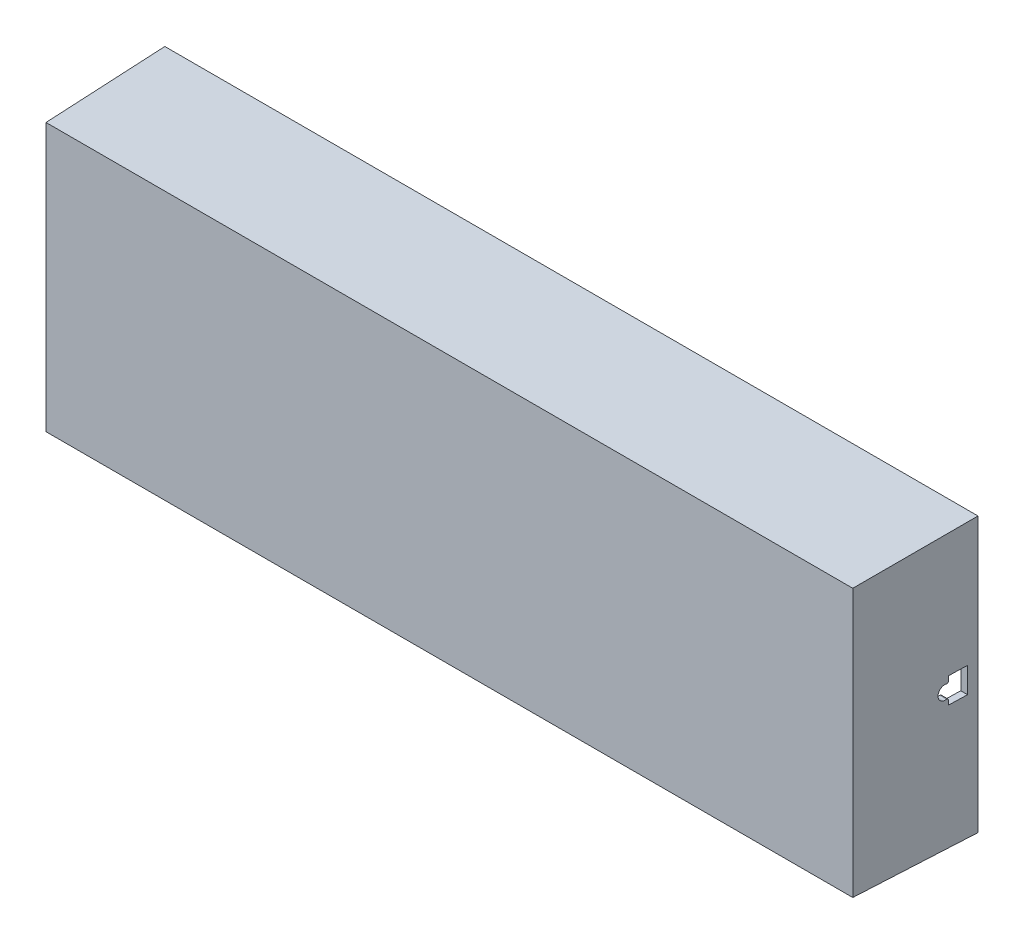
ISO-10303-21;
HEADER;
FILE_DESCRIPTION(('STEP AP214'),'2;1');
FILE_NAME('part.step','',(''),(''),'','','');
FILE_SCHEMA(('AUTOMOTIVE_DESIGN { 1 0 10303 214 1 1 1 1 }'));
ENDSEC;
DATA;
#1=APPLICATION_CONTEXT('core data for automotive mechanical design processes');
#2=APPLICATION_PROTOCOL_DEFINITION('international standard','automotive_design',2000,#1);
#3=PRODUCT_CONTEXT('',#1,'mechanical');
#4=PRODUCT('Part','Part','',(#3));
#5=PRODUCT_RELATED_PRODUCT_CATEGORY('part','',(#4));
#6=PRODUCT_DEFINITION_FORMATION('','',#4);
#7=PRODUCT_DEFINITION_CONTEXT('part definition',#1,'design');
#8=PRODUCT_DEFINITION('design','',#6,#7);
#9=PRODUCT_DEFINITION_SHAPE('','',#8);
#10=(LENGTH_UNIT() NAMED_UNIT(*) SI_UNIT(.MILLI.,.METRE.));
#11=(NAMED_UNIT(*) PLANE_ANGLE_UNIT() SI_UNIT($,.RADIAN.));
#12=(NAMED_UNIT(*) SI_UNIT($,.STERADIAN.) SOLID_ANGLE_UNIT());
#13=UNCERTAINTY_MEASURE_WITH_UNIT(LENGTH_MEASURE(1.E-05),#10,'distance_accuracy_value','');
#14=(GEOMETRIC_REPRESENTATION_CONTEXT(3) GLOBAL_UNCERTAINTY_ASSIGNED_CONTEXT((#13)) GLOBAL_UNIT_ASSIGNED_CONTEXT((#10,
#11,#12)) REPRESENTATION_CONTEXT('',''));
#15=CARTESIAN_POINT('',(0.,0.,0.));
#16=DIRECTION('',(0.,0.,1.));
#17=DIRECTION('',(1.,0.,0.));
#18=AXIS2_PLACEMENT_3D('',#15,#16,#17);
#19=CARTESIAN_POINT('',(-119.95,40.45,0.));
#20=DIRECTION('',(-0.999657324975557,0.,0.0261769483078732));
#21=DIRECTION('',(0.0261769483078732,0.,0.999657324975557));
#22=AXIS2_PLACEMENT_3D('',#19,#20,#21);
#23=PLANE('',#22);
#24=DIRECTION('',(0.0261769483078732,0.,0.999657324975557));
#25=VECTOR('',#24,1.);
#26=CARTESIAN_POINT('',(-119.95,-3.75,0.));
#27=LINE('',#26,#25);
#28=CARTESIAN_POINT('',(-119.727419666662,-3.75,8.5));
#29=VERTEX_POINT('',#28);
#30=CARTESIAN_POINT('',(-119.871442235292,-3.75,3.));
#31=VERTEX_POINT('',#30);
#32=EDGE_CURVE('E310',#29,#31,#27,.F.);
#33=ORIENTED_EDGE('',*,*,#32,.T.);
#34=DIRECTION('',(0.,-1.,0.));
#35=VECTOR('',#34,1.);
#36=CARTESIAN_POINT('',(-119.871442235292,40.45,3.));
#37=LINE('',#36,#35);
#38=CARTESIAN_POINT('',(-119.871442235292,3.75,3.));
#39=VERTEX_POINT('',#38);
#40=EDGE_CURVE('E302',#31,#39,#37,.F.);
#41=ORIENTED_EDGE('',*,*,#40,.T.);
#42=DIRECTION('',(-0.0261769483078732,0.,-0.999657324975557));
#43=VECTOR('',#42,1.);
#44=CARTESIAN_POINT('',(-119.95,3.75,0.));
#45=LINE('',#44,#43);
#46=CARTESIAN_POINT('',(-119.727419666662,3.75,8.5));
#47=VERTEX_POINT('',#46);
#48=EDGE_CURVE('E288',#39,#47,#45,.F.);
#49=ORIENTED_EDGE('',*,*,#48,.T.);
#50=DIRECTION('',(0.,1.,0.));
#51=VECTOR('',#50,1.);
#52=CARTESIAN_POINT('',(-119.727419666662,40.45,8.5));
#53=LINE('',#52,#51);
#54=CARTESIAN_POINT('',(-119.727419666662,2.44948974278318,8.5));
#55=VERTEX_POINT('',#54);
#56=EDGE_CURVE('E922',#47,#55,#53,.F.);
#57=ORIENTED_EDGE('',*,*,#56,.T.);
#58=CARTESIAN_POINT('',(-119.714326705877,2.44948974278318,9.));
#59=DIRECTION('',(-0.999657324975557,0.,0.0261769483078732));
#60=DIRECTION('',(0.0261769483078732,0.,0.999657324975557));
#61=AXIS2_PLACEMENT_3D('',#58,#59,#60);
#62=ELLIPSE('',#61,0.500171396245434,0.5);
#63=CARTESIAN_POINT('',(-119.71170811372,1.95959179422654,9.1));
#64=VERTEX_POINT('',#63);
#65=EDGE_CURVE('E929',#55,#64,#62,.T.);
#66=ORIENTED_EDGE('',*,*,#65,.T.);
#67=CARTESIAN_POINT('',(-119.701233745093,0.,9.5));
#68=DIRECTION('',(-0.999657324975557,0.,0.0261769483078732));
#69=DIRECTION('',(0.0261769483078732,0.,0.999657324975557));
#70=AXIS2_PLACEMENT_3D('',#67,#68,#69);
#71=ELLIPSE('',#70,2.00068558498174,2.);
#72=CARTESIAN_POINT('',(-119.71170811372,-1.95959179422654,9.1));
#73=VERTEX_POINT('',#72);
#74=EDGE_CURVE('E938',#64,#73,#71,.F.);
#75=ORIENTED_EDGE('',*,*,#74,.T.);
#76=CARTESIAN_POINT('',(-119.714326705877,-2.44948974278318,9.));
#77=DIRECTION('',(-0.999657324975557,0.,0.0261769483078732));
#78=DIRECTION('',(0.0261769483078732,0.,0.999657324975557));
#79=AXIS2_PLACEMENT_3D('',#76,#77,#78);
#80=ELLIPSE('',#79,0.500171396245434,0.5);
#81=CARTESIAN_POINT('',(-119.727419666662,-2.44948974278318,8.5));
#82=VERTEX_POINT('',#81);
#83=EDGE_CURVE('E947',#73,#82,#80,.T.);
#84=ORIENTED_EDGE('',*,*,#83,.T.);
#85=DIRECTION('',(0.,1.,0.));
#86=VECTOR('',#85,1.);
#87=CARTESIAN_POINT('',(-119.727419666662,40.45,8.5));
#88=LINE('',#87,#86);
#89=EDGE_CURVE('E956',#82,#29,#88,.F.);
#90=ORIENTED_EDGE('',*,*,#89,.T.);
#91=EDGE_LOOP('',(#33,#41,#49,#57,#66,#75,#84,#90));
#92=FACE_BOUND('',#91,.T.);
#93=DIRECTION('',(0.,-1.,0.));
#94=VECTOR('',#93,1.);
#95=CARTESIAN_POINT('',(-119.95,40.45,0.));
#96=LINE('',#95,#94);
#97=CARTESIAN_POINT('',(-119.95,40.45,0.));
#98=VERTEX_POINT('',#97);
#99=CARTESIAN_POINT('',(-119.95,-40.45,0.));
#100=VERTEX_POINT('',#99);
#101=EDGE_CURVE('E478',#98,#100,#96,.T.);
#102=ORIENTED_EDGE('',*,*,#101,.T.);
#103=DIRECTION('',(-0.0261679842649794,-0.0261679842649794,-0.99931500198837));
#104=VECTOR('',#103,1.);
#105=CARTESIAN_POINT('',(-119.95,-40.45,0.));
#106=LINE('',#105,#104);
#107=CARTESIAN_POINT('',(-119.007306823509,-39.5073068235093,36.));
#108=VERTEX_POINT('',#107);
#109=EDGE_CURVE('E465',#108,#100,#106,.T.);
#110=ORIENTED_EDGE('',*,*,#109,.F.);
#111=DIRECTION('',(0.,1.,0.));
#112=VECTOR('',#111,1.);
#113=CARTESIAN_POINT('',(-119.007306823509,40.45,36.));
#114=LINE('',#113,#112);
#115=CARTESIAN_POINT('',(-119.007306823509,39.5073068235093,36.));
#116=VERTEX_POINT('',#115);
#117=EDGE_CURVE('E458',#116,#108,#114,.F.);
#118=ORIENTED_EDGE('',*,*,#117,.F.);
#119=DIRECTION('',(-0.0261679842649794,0.0261679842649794,-0.99931500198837));
#120=VECTOR('',#119,1.);
#121=CARTESIAN_POINT('',(-119.95,40.45,0.));
#122=LINE('',#121,#120);
#123=EDGE_CURVE('E453',#116,#98,#122,.T.);
#124=ORIENTED_EDGE('',*,*,#123,.T.);
#125=EDGE_LOOP('',(#102,#110,#118,#124));
#126=FACE_BOUND('',#125,.T.);
#127=ADVANCED_FACE('F33',(#92,#126),#23,.T.);
#128=CARTESIAN_POINT('',(-119.95,-40.45,0.));
#129=DIRECTION('',(0.,-0.999657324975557,0.0261769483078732));
#130=DIRECTION('',(0.,-0.0261769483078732,-0.999657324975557));
#131=AXIS2_PLACEMENT_3D('',#128,#129,#130);
#132=PLANE('',#131);
#133=DIRECTION('',(1.,0.,0.));
#134=VECTOR('',#133,1.);
#135=CARTESIAN_POINT('',(-119.95,-40.45,0.));
#136=LINE('',#135,#134);
#137=CARTESIAN_POINT('',(119.95,-40.45,0.));
#138=VERTEX_POINT('',#137);
#139=EDGE_CURVE('E476',#100,#138,#136,.T.);
#140=ORIENTED_EDGE('',*,*,#139,.T.);
#141=DIRECTION('',(0.0261679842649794,-0.0261679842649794,-0.99931500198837));
#142=VECTOR('',#141,1.);
#143=CARTESIAN_POINT('',(119.8946026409,-40.3946026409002,2.11553979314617));
#144=LINE('',#143,#142);
#145=CARTESIAN_POINT('',(119.007306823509,-39.5073068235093,36.));
#146=VERTEX_POINT('',#145);
#147=EDGE_CURVE('E462',#146,#138,#144,.T.);
#148=ORIENTED_EDGE('',*,*,#147,.F.);
#149=DIRECTION('',(-1.,0.,0.));
#150=VECTOR('',#149,1.);
#151=CARTESIAN_POINT('',(-119.95,-39.5073068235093,36.));
#152=LINE('',#151,#150);
#153=EDGE_CURVE('E456',#108,#146,#152,.F.);
#154=ORIENTED_EDGE('',*,*,#153,.F.);
#155=ORIENTED_EDGE('',*,*,#109,.T.);
#156=EDGE_LOOP('',(#140,#148,#154,#155));
#157=FACE_BOUND('',#156,.T.);
#158=ADVANCED_FACE('F35',(#157),#132,.T.);
#159=CARTESIAN_POINT('',(119.95,40.45,0.));
#160=DIRECTION('',(0.999657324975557,0.,0.0261769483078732));
#161=DIRECTION('',(0.0261769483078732,0.,-0.999657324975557));
#162=AXIS2_PLACEMENT_3D('',#159,#160,#161);
#163=PLANE('',#162);
#164=DIRECTION('',(-0.0261769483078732,0.,0.999657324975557));
#165=VECTOR('',#164,1.);
#166=CARTESIAN_POINT('',(119.95,3.75,0.));
#167=LINE('',#166,#165);
#168=CARTESIAN_POINT('',(119.727419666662,3.75,8.5));
#169=VERTEX_POINT('',#168);
#170=CARTESIAN_POINT('',(119.871442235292,3.75,3.));
#171=VERTEX_POINT('',#170);
#172=EDGE_CURVE('E297',#169,#171,#167,.F.);
#173=ORIENTED_EDGE('',*,*,#172,.T.);
#174=DIRECTION('',(0.,1.,0.));
#175=VECTOR('',#174,1.);
#176=CARTESIAN_POINT('',(119.871442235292,40.45,3.));
#177=LINE('',#176,#175);
#178=CARTESIAN_POINT('',(119.871442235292,-3.75,3.));
#179=VERTEX_POINT('',#178);
#180=EDGE_CURVE('E312',#171,#179,#177,.F.);
#181=ORIENTED_EDGE('',*,*,#180,.T.);
#182=DIRECTION('',(0.0261769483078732,0.,-0.999657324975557));
#183=VECTOR('',#182,1.);
#184=CARTESIAN_POINT('',(119.95,-3.75,0.));
#185=LINE('',#184,#183);
#186=CARTESIAN_POINT('',(119.727419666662,-3.75,8.5));
#187=VERTEX_POINT('',#186);
#188=EDGE_CURVE('E960',#179,#187,#185,.F.);
#189=ORIENTED_EDGE('',*,*,#188,.T.);
#190=DIRECTION('',(0.,-1.,0.));
#191=VECTOR('',#190,1.);
#192=CARTESIAN_POINT('',(119.727419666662,40.45,8.5));
#193=LINE('',#192,#191);
#194=CARTESIAN_POINT('',(119.727419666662,-2.44948974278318,8.5));
#195=VERTEX_POINT('',#194);
#196=EDGE_CURVE('E953',#187,#195,#193,.F.);
#197=ORIENTED_EDGE('',*,*,#196,.T.);
#198=CARTESIAN_POINT('',(119.714326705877,-2.44948974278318,9.));
#199=DIRECTION('',(0.999657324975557,0.,0.0261769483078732));
#200=DIRECTION('',(0.0261769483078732,0.,-0.999657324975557));
#201=AXIS2_PLACEMENT_3D('',#198,#199,#200);
#202=ELLIPSE('',#201,0.500171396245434,0.5);
#203=CARTESIAN_POINT('',(119.71170811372,-1.95959179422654,9.1));
#204=VERTEX_POINT('',#203);
#205=EDGE_CURVE('E944',#195,#204,#202,.T.);
#206=ORIENTED_EDGE('',*,*,#205,.T.);
#207=CARTESIAN_POINT('',(119.701233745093,0.,9.5));
#208=DIRECTION('',(0.999657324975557,0.,0.0261769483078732));
#209=DIRECTION('',(0.0261769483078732,0.,-0.999657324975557));
#210=AXIS2_PLACEMENT_3D('',#207,#208,#209);
#211=ELLIPSE('',#210,2.00068558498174,2.);
#212=CARTESIAN_POINT('',(119.71170811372,1.95959179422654,9.1));
#213=VERTEX_POINT('',#212);
#214=EDGE_CURVE('E935',#204,#213,#211,.F.);
#215=ORIENTED_EDGE('',*,*,#214,.T.);
#216=CARTESIAN_POINT('',(119.714326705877,2.44948974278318,9.));
#217=DIRECTION('',(0.999657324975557,0.,0.0261769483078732));
#218=DIRECTION('',(0.0261769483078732,0.,-0.999657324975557));
#219=AXIS2_PLACEMENT_3D('',#216,#217,#218);
#220=ELLIPSE('',#219,0.500171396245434,0.5);
#221=CARTESIAN_POINT('',(119.727419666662,2.44948974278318,8.5));
#222=VERTEX_POINT('',#221);
#223=EDGE_CURVE('E926',#213,#222,#220,.T.);
#224=ORIENTED_EDGE('',*,*,#223,.T.);
#225=DIRECTION('',(0.,-1.,0.));
#226=VECTOR('',#225,1.);
#227=CARTESIAN_POINT('',(119.727419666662,40.45,8.5));
#228=LINE('',#227,#226);
#229=EDGE_CURVE('E910',#222,#169,#228,.F.);
#230=ORIENTED_EDGE('',*,*,#229,.T.);
#231=EDGE_LOOP('',(#173,#181,#189,#197,#206,#215,#224,#230));
#232=FACE_BOUND('',#231,.T.);
#233=DIRECTION('',(0.,1.,0.));
#234=VECTOR('',#233,1.);
#235=CARTESIAN_POINT('',(119.95,40.45,0.));
#236=LINE('',#235,#234);
#237=CARTESIAN_POINT('',(119.95,40.45,0.));
#238=VERTEX_POINT('',#237);
#239=EDGE_CURVE('E474',#138,#238,#236,.T.);
#240=ORIENTED_EDGE('',*,*,#239,.T.);
#241=DIRECTION('',(0.0261679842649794,0.0261679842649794,-0.99931500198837));
#242=VECTOR('',#241,1.);
#243=CARTESIAN_POINT('',(119.785725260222,40.2857252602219,6.2733992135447));
#244=LINE('',#243,#242);
#245=CARTESIAN_POINT('',(119.007306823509,39.5073068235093,36.));
#246=VERTEX_POINT('',#245);
#247=EDGE_CURVE('E466',#246,#238,#244,.T.);
#248=ORIENTED_EDGE('',*,*,#247,.F.);
#249=DIRECTION('',(0.,-1.,0.));
#250=VECTOR('',#249,1.);
#251=CARTESIAN_POINT('',(119.007306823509,40.45,36.));
#252=LINE('',#251,#250);
#253=EDGE_CURVE('E454',#146,#246,#252,.F.);
#254=ORIENTED_EDGE('',*,*,#253,.F.);
#255=ORIENTED_EDGE('',*,*,#147,.T.);
#256=EDGE_LOOP('',(#240,#248,#254,#255));
#257=FACE_BOUND('',#256,.T.);
#258=ADVANCED_FACE('F560',(#232,#257),#163,.T.);
#259=CARTESIAN_POINT('',(-119.95,40.45,0.));
#260=DIRECTION('',(0.,0.999657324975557,0.0261769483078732));
#261=DIRECTION('',(0.,-0.0261769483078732,0.999657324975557));
#262=AXIS2_PLACEMENT_3D('',#259,#260,#261);
#263=PLANE('',#262);
#264=DIRECTION('',(-1.,0.,0.));
#265=VECTOR('',#264,1.);
#266=CARTESIAN_POINT('',(-119.95,40.45,0.));
#267=LINE('',#266,#265);
#268=EDGE_CURVE('E461',#238,#98,#267,.T.);
#269=ORIENTED_EDGE('',*,*,#268,.T.);
#270=ORIENTED_EDGE('',*,*,#123,.F.);
#271=DIRECTION('',(1.,0.,0.));
#272=VECTOR('',#271,1.);
#273=CARTESIAN_POINT('',(-119.95,39.5073068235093,36.));
#274=LINE('',#273,#272);
#275=EDGE_CURVE('E451',#246,#116,#274,.F.);
#276=ORIENTED_EDGE('',*,*,#275,.F.);
#277=ORIENTED_EDGE('',*,*,#247,.T.);
#278=EDGE_LOOP('',(#269,#270,#276,#277));
#279=FACE_BOUND('',#278,.T.);
#280=ADVANCED_FACE('F566',(#279),#263,.T.);
#281=CARTESIAN_POINT('',(-119.95,-40.45,36.));
#282=DIRECTION('',(0.,0.,1.));
#283=DIRECTION('',(1.,0.,0.));
#284=AXIS2_PLACEMENT_3D('',#281,#282,#283);
#285=PLANE('',#284);
#286=ORIENTED_EDGE('',*,*,#117,.T.);
#287=ORIENTED_EDGE('',*,*,#153,.T.);
#288=ORIENTED_EDGE('',*,*,#253,.T.);
#289=ORIENTED_EDGE('',*,*,#275,.T.);
#290=EDGE_LOOP('',(#286,#287,#288,#289));
#291=FACE_BOUND('',#290,.T.);
#292=ADVANCED_FACE('F564',(#291),#285,.T.);
#293=CARTESIAN_POINT('',(-119.95,-40.45,0.));
#294=DIRECTION('',(0.,0.,1.));
#295=DIRECTION('',(1.,0.,0.));
#296=AXIS2_PLACEMENT_3D('',#293,#294,#295);
#297=PLANE('',#296);
#298=DIRECTION('',(-1.,0.,0.));
#299=VECTOR('',#298,1.);
#300=CARTESIAN_POINT('',(-6.45,39.45,0.));
#301=LINE('',#300,#299);
#302=CARTESIAN_POINT('',(-6.45,39.45,0.));
#303=VERTEX_POINT('',#302);
#304=CARTESIAN_POINT('',(-34.45,39.45,0.));
#305=VERTEX_POINT('',#304);
#306=EDGE_CURVE('E324',#303,#305,#301,.T.);
#307=ORIENTED_EDGE('',*,*,#306,.T.);
#308=DIRECTION('',(0.,-1.,0.));
#309=VECTOR('',#308,1.);
#310=CARTESIAN_POINT('',(-34.45,38.45,0.));
#311=LINE('',#310,#309);
#312=CARTESIAN_POINT('',(-34.45,38.45,0.));
#313=VERTEX_POINT('',#312);
#314=EDGE_CURVE('E327',#305,#313,#311,.T.);
#315=ORIENTED_EDGE('',*,*,#314,.T.);
#316=DIRECTION('',(1.,0.,0.));
#317=VECTOR('',#316,1.);
#318=CARTESIAN_POINT('',(117.95,38.45,0.));
#319=LINE('',#318,#317);
#320=CARTESIAN_POINT('',(-117.95,38.45,0.));
#321=VERTEX_POINT('',#320);
#322=EDGE_CURVE('E495',#321,#313,#319,.T.);
#323=ORIENTED_EDGE('',*,*,#322,.F.);
#324=DIRECTION('',(0.,1.,0.));
#325=VECTOR('',#324,1.);
#326=CARTESIAN_POINT('',(-117.95,38.45,0.));
#327=LINE('',#326,#325);
#328=CARTESIAN_POINT('',(-117.95,-38.45,0.));
#329=VERTEX_POINT('',#328);
#330=EDGE_CURVE('E442',#329,#321,#327,.T.);
#331=ORIENTED_EDGE('',*,*,#330,.F.);
#332=DIRECTION('',(-1.,0.,0.));
#333=VECTOR('',#332,1.);
#334=CARTESIAN_POINT('',(117.95,-38.45,0.));
#335=LINE('',#334,#333);
#336=CARTESIAN_POINT('',(-34.45,-38.45,0.));
#337=VERTEX_POINT('',#336);
#338=EDGE_CURVE('E434',#337,#329,#335,.T.);
#339=ORIENTED_EDGE('',*,*,#338,.F.);
#340=DIRECTION('',(0.,-1.,0.));
#341=VECTOR('',#340,1.);
#342=CARTESIAN_POINT('',(-34.45,-38.45,0.));
#343=LINE('',#342,#341);
#344=CARTESIAN_POINT('',(-34.45,-39.45,0.));
#345=VERTEX_POINT('',#344);
#346=EDGE_CURVE('E1036',#337,#345,#343,.T.);
#347=ORIENTED_EDGE('',*,*,#346,.T.);
#348=DIRECTION('',(1.,0.,0.));
#349=VECTOR('',#348,1.);
#350=CARTESIAN_POINT('',(-6.45,-39.45,0.));
#351=LINE('',#350,#349);
#352=CARTESIAN_POINT('',(-6.45,-39.45,0.));
#353=VERTEX_POINT('',#352);
#354=EDGE_CURVE('E421',#345,#353,#351,.T.);
#355=ORIENTED_EDGE('',*,*,#354,.T.);
#356=DIRECTION('',(0.,1.,0.));
#357=VECTOR('',#356,1.);
#358=CARTESIAN_POINT('',(-6.45,-38.45,0.));
#359=LINE('',#358,#357);
#360=CARTESIAN_POINT('',(-6.45,-38.45,0.));
#361=VERTEX_POINT('',#360);
#362=EDGE_CURVE('E412',#353,#361,#359,.T.);
#363=ORIENTED_EDGE('',*,*,#362,.T.);
#364=CARTESIAN_POINT('',(6.45,-38.45,0.));
#365=VERTEX_POINT('',#364);
#366=EDGE_CURVE('E430',#365,#361,#335,.T.);
#367=ORIENTED_EDGE('',*,*,#366,.F.);
#368=DIRECTION('',(0.,-1.,0.));
#369=VECTOR('',#368,1.);
#370=CARTESIAN_POINT('',(6.45,-38.45,0.));
#371=LINE('',#370,#369);
#372=CARTESIAN_POINT('',(6.45,-39.45,0.));
#373=VERTEX_POINT('',#372);
#374=EDGE_CURVE('E388',#365,#373,#371,.T.);
#375=ORIENTED_EDGE('',*,*,#374,.T.);
#376=DIRECTION('',(1.,0.,0.));
#377=VECTOR('',#376,1.);
#378=CARTESIAN_POINT('',(6.45,-39.45,0.));
#379=LINE('',#378,#377);
#380=CARTESIAN_POINT('',(34.45,-39.45,0.));
#381=VERTEX_POINT('',#380);
#382=EDGE_CURVE('E391',#373,#381,#379,.T.);
#383=ORIENTED_EDGE('',*,*,#382,.T.);
#384=DIRECTION('',(0.,1.,0.));
#385=VECTOR('',#384,1.);
#386=CARTESIAN_POINT('',(34.45,-38.45,0.));
#387=LINE('',#386,#385);
#388=CARTESIAN_POINT('',(34.45,-38.45,0.));
#389=VERTEX_POINT('',#388);
#390=EDGE_CURVE('E394',#381,#389,#387,.T.);
#391=ORIENTED_EDGE('',*,*,#390,.T.);
#392=CARTESIAN_POINT('',(117.95,-38.45,0.));
#393=VERTEX_POINT('',#392);
#394=EDGE_CURVE('E433',#393,#389,#335,.T.);
#395=ORIENTED_EDGE('',*,*,#394,.F.);
#396=DIRECTION('',(0.,-1.,0.));
#397=VECTOR('',#396,1.);
#398=CARTESIAN_POINT('',(117.95,38.45,0.));
#399=LINE('',#398,#397);
#400=CARTESIAN_POINT('',(117.95,38.45,0.));
#401=VERTEX_POINT('',#400);
#402=EDGE_CURVE('E440',#401,#393,#399,.T.);
#403=ORIENTED_EDGE('',*,*,#402,.F.);
#404=CARTESIAN_POINT('',(34.45,38.45,0.));
#405=VERTEX_POINT('',#404);
#406=EDGE_CURVE('E506',#405,#401,#319,.T.);
#407=ORIENTED_EDGE('',*,*,#406,.F.);
#408=DIRECTION('',(0.,1.,0.));
#409=VECTOR('',#408,1.);
#410=CARTESIAN_POINT('',(34.45,38.45,0.));
#411=LINE('',#410,#409);
#412=CARTESIAN_POINT('',(34.45,39.45,0.));
#413=VERTEX_POINT('',#412);
#414=EDGE_CURVE('E357',#405,#413,#411,.T.);
#415=ORIENTED_EDGE('',*,*,#414,.T.);
#416=DIRECTION('',(-1.,0.,0.));
#417=VECTOR('',#416,1.);
#418=CARTESIAN_POINT('',(6.45,39.45,0.));
#419=LINE('',#418,#417);
#420=CARTESIAN_POINT('',(6.45,39.45,0.));
#421=VERTEX_POINT('',#420);
#422=EDGE_CURVE('E360',#413,#421,#419,.T.);
#423=ORIENTED_EDGE('',*,*,#422,.T.);
#424=DIRECTION('',(0.,-1.,0.));
#425=VECTOR('',#424,1.);
#426=CARTESIAN_POINT('',(6.45,38.45,0.));
#427=LINE('',#426,#425);
#428=CARTESIAN_POINT('',(6.45,38.45,0.));
#429=VERTEX_POINT('',#428);
#430=EDGE_CURVE('E345',#421,#429,#427,.T.);
#431=ORIENTED_EDGE('',*,*,#430,.T.);
#432=CARTESIAN_POINT('',(-6.45,38.45,0.));
#433=VERTEX_POINT('',#432);
#434=EDGE_CURVE('E505',#433,#429,#319,.T.);
#435=ORIENTED_EDGE('',*,*,#434,.F.);
#436=DIRECTION('',(0.,1.,0.));
#437=VECTOR('',#436,1.);
#438=CARTESIAN_POINT('',(-6.45,38.45,0.));
#439=LINE('',#438,#437);
#440=EDGE_CURVE('E315',#433,#303,#439,.T.);
#441=ORIENTED_EDGE('',*,*,#440,.T.);
#442=EDGE_LOOP('',(#307,#315,#323,#331,#339,#347,#355,#363,#367,#375,#383,#391,#395,#403,#407,
#415,#423,#431,#435,#441));
#443=FACE_BOUND('',#442,.T.);
#444=ORIENTED_EDGE('',*,*,#101,.F.);
#445=ORIENTED_EDGE('',*,*,#268,.F.);
#446=ORIENTED_EDGE('',*,*,#239,.F.);
#447=ORIENTED_EDGE('',*,*,#139,.F.);
#448=EDGE_LOOP('',(#444,#445,#446,#447));
#449=FACE_BOUND('',#448,.T.);
#450=ADVANCED_FACE('F517',(#443,#449),#297,.F.);
#451=CARTESIAN_POINT('',(117.95,38.45,0.));
#452=DIRECTION('',(0.999657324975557,0.,0.0261769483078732));
#453=DIRECTION('',(0.0261769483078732,0.,-0.999657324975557));
#454=AXIS2_PLACEMENT_3D('',#451,#452,#453);
#455=PLANE('',#454);
#456=DIRECTION('',(0.0261769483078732,0.,-0.999657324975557));
#457=VECTOR('',#456,1.);
#458=CARTESIAN_POINT('',(117.95,-3.75,0.));
#459=LINE('',#458,#457);
#460=CARTESIAN_POINT('',(117.727419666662,-3.75,8.5));
#461=VERTEX_POINT('',#460);
#462=CARTESIAN_POINT('',(117.871442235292,-3.75,3.));
#463=VERTEX_POINT('',#462);
#464=EDGE_CURVE('E958',#461,#463,#459,.T.);
#465=ORIENTED_EDGE('',*,*,#464,.T.);
#466=DIRECTION('',(0.,1.,0.));
#467=VECTOR('',#466,1.);
#468=CARTESIAN_POINT('',(117.871442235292,38.45,3.));
#469=LINE('',#468,#467);
#470=CARTESIAN_POINT('',(117.871442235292,3.75,3.));
#471=VERTEX_POINT('',#470);
#472=EDGE_CURVE('E318',#463,#471,#469,.T.);
#473=ORIENTED_EDGE('',*,*,#472,.T.);
#474=DIRECTION('',(-0.0261769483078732,0.,0.999657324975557));
#475=VECTOR('',#474,1.);
#476=CARTESIAN_POINT('',(117.95,3.75,0.));
#477=LINE('',#476,#475);
#478=CARTESIAN_POINT('',(117.727419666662,3.74999999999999,8.5));
#479=VERTEX_POINT('',#478);
#480=EDGE_CURVE('E903',#471,#479,#477,.T.);
#481=ORIENTED_EDGE('',*,*,#480,.T.);
#482=DIRECTION('',(0.,-1.,0.));
#483=VECTOR('',#482,1.);
#484=CARTESIAN_POINT('',(117.727419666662,38.45,8.5));
#485=LINE('',#484,#483);
#486=CARTESIAN_POINT('',(117.727419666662,2.44948974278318,8.5));
#487=VERTEX_POINT('',#486);
#488=EDGE_CURVE('E296',#479,#487,#485,.T.);
#489=ORIENTED_EDGE('',*,*,#488,.T.);
#490=CARTESIAN_POINT('',(117.714326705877,2.44948974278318,9.));
#491=DIRECTION('',(0.999657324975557,0.,0.0261769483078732));
#492=DIRECTION('',(0.0261769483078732,0.,-0.999657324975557));
#493=AXIS2_PLACEMENT_3D('',#490,#491,#492);
#494=ELLIPSE('',#493,0.500171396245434,0.5);
#495=CARTESIAN_POINT('',(117.71170811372,1.95959179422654,9.1));
#496=VERTEX_POINT('',#495);
#497=EDGE_CURVE('E924',#487,#496,#494,.F.);
#498=ORIENTED_EDGE('',*,*,#497,.T.);
#499=CARTESIAN_POINT('',(117.701233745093,0.,9.5));
#500=DIRECTION('',(0.999657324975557,0.,0.0261769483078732));
#501=DIRECTION('',(0.0261769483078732,0.,-0.999657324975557));
#502=AXIS2_PLACEMENT_3D('',#499,#500,#501);
#503=ELLIPSE('',#502,2.00068558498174,2.);
#504=CARTESIAN_POINT('',(117.71170811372,-1.95959179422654,9.1));
#505=VERTEX_POINT('',#504);
#506=EDGE_CURVE('E932',#496,#505,#503,.T.);
#507=ORIENTED_EDGE('',*,*,#506,.T.);
#508=CARTESIAN_POINT('',(117.714326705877,-2.44948974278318,9.));
#509=DIRECTION('',(0.999657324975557,0.,0.0261769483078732));
#510=DIRECTION('',(0.0261769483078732,0.,-0.999657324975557));
#511=AXIS2_PLACEMENT_3D('',#508,#509,#510);
#512=ELLIPSE('',#511,0.500171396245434,0.5);
#513=CARTESIAN_POINT('',(117.727419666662,-2.44948974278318,8.5));
#514=VERTEX_POINT('',#513);
#515=EDGE_CURVE('E941',#505,#514,#512,.F.);
#516=ORIENTED_EDGE('',*,*,#515,.T.);
#517=DIRECTION('',(0.,-1.,0.));
#518=VECTOR('',#517,1.);
#519=CARTESIAN_POINT('',(117.727419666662,38.45,8.5));
#520=LINE('',#519,#518);
#521=EDGE_CURVE('E950',#514,#461,#520,.T.);
#522=ORIENTED_EDGE('',*,*,#521,.T.);
#523=EDGE_LOOP('',(#465,#473,#481,#489,#498,#507,#516,#522));
#524=FACE_BOUND('',#523,.T.);
#525=ORIENTED_EDGE('',*,*,#402,.T.);
#526=DIRECTION('',(0.0261679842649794,-0.0261679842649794,-0.99931500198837));
#527=VECTOR('',#526,1.);
#528=CARTESIAN_POINT('',(117.897341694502,-38.3973416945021,2.01093955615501));
#529=LINE('',#528,#527);
#530=CARTESIAN_POINT('',(117.059678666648,-37.5596786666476,34.));
#531=VERTEX_POINT('',#530);
#532=EDGE_CURVE('E492',#531,#393,#529,.T.);
#533=ORIENTED_EDGE('',*,*,#532,.F.);
#534=DIRECTION('',(0.,-1.,0.));
#535=VECTOR('',#534,1.);
#536=CARTESIAN_POINT('',(117.059678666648,-38.45,34.));
#537=LINE('',#536,#535);
#538=CARTESIAN_POINT('',(117.059678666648,37.5596786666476,34.));
#539=VERTEX_POINT('',#538);
#540=EDGE_CURVE('E486',#539,#531,#537,.T.);
#541=ORIENTED_EDGE('',*,*,#540,.F.);
#542=DIRECTION('',(0.0261679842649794,0.0261679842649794,-0.99931500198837));
#543=VECTOR('',#542,1.);
#544=CARTESIAN_POINT('',(117.95,38.45,0.));
#545=LINE('',#544,#543);
#546=EDGE_CURVE('E481',#539,#401,#545,.T.);
#547=ORIENTED_EDGE('',*,*,#546,.T.);
#548=EDGE_LOOP('',(#525,#533,#541,#547));
#549=FACE_BOUND('',#548,.T.);
#550=ADVANCED_FACE('F591',(#524,#549),#455,.F.);
#551=CARTESIAN_POINT('',(117.95,38.45,0.));
#552=DIRECTION('',(0.,0.999657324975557,0.0261769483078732));
#553=DIRECTION('',(0.,-0.0261769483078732,0.999657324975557));
#554=AXIS2_PLACEMENT_3D('',#551,#552,#553);
#555=PLANE('',#554);
#556=ORIENTED_EDGE('',*,*,#322,.T.);
#557=DIRECTION('',(1.,0.,0.));
#558=VECTOR('',#557,1.);
#559=CARTESIAN_POINT('',(-6.45,38.45,0.));
#560=LINE('',#559,#558);
#561=EDGE_CURVE('E311',#313,#433,#560,.T.);
#562=ORIENTED_EDGE('',*,*,#561,.T.);
#563=ORIENTED_EDGE('',*,*,#434,.T.);
#564=DIRECTION('',(1.,0.,0.));
#565=VECTOR('',#564,1.);
#566=CARTESIAN_POINT('',(6.45,38.45,0.));
#567=LINE('',#566,#565);
#568=EDGE_CURVE('E354',#429,#405,#567,.T.);
#569=ORIENTED_EDGE('',*,*,#568,.T.);
#570=ORIENTED_EDGE('',*,*,#406,.T.);
#571=ORIENTED_EDGE('',*,*,#546,.F.);
#572=DIRECTION('',(1.,0.,0.));
#573=VECTOR('',#572,1.);
#574=CARTESIAN_POINT('',(117.95,37.5596786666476,34.));
#575=LINE('',#574,#573);
#576=CARTESIAN_POINT('',(-117.059678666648,37.5596786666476,34.));
#577=VERTEX_POINT('',#576);
#578=EDGE_CURVE('E489',#577,#539,#575,.T.);
#579=ORIENTED_EDGE('',*,*,#578,.F.);
#580=DIRECTION('',(-0.0261679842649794,0.0261679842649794,-0.99931500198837));
#581=VECTOR('',#580,1.);
#582=CARTESIAN_POINT('',(-117.95,38.45,0.));
#583=LINE('',#582,#581);
#584=EDGE_CURVE('E496',#577,#321,#583,.T.);
#585=ORIENTED_EDGE('',*,*,#584,.T.);
#586=EDGE_LOOP('',(#556,#562,#563,#569,#570,#571,#579,#585));
#587=FACE_BOUND('',#586,.T.);
#588=ADVANCED_FACE('F529',(#587),#555,.F.);
#589=CARTESIAN_POINT('',(-117.95,38.45,0.));
#590=DIRECTION('',(-0.999657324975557,0.,0.0261769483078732));
#591=DIRECTION('',(0.0261769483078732,0.,0.999657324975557));
#592=AXIS2_PLACEMENT_3D('',#589,#590,#591);
#593=PLANE('',#592);
#594=DIRECTION('',(-0.0261769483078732,0.,-0.999657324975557));
#595=VECTOR('',#594,1.);
#596=CARTESIAN_POINT('',(-117.95,3.75,0.));
#597=LINE('',#596,#595);
#598=CARTESIAN_POINT('',(-117.727419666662,3.75,8.5));
#599=VERTEX_POINT('',#598);
#600=CARTESIAN_POINT('',(-117.871442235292,3.75,3.));
#601=VERTEX_POINT('',#600);
#602=EDGE_CURVE('E435',#599,#601,#597,.T.);
#603=ORIENTED_EDGE('',*,*,#602,.T.);
#604=DIRECTION('',(0.,-1.,0.));
#605=VECTOR('',#604,1.);
#606=CARTESIAN_POINT('',(-117.871442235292,38.45,3.));
#607=LINE('',#606,#605);
#608=CARTESIAN_POINT('',(-117.871442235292,-3.75,3.));
#609=VERTEX_POINT('',#608);
#610=EDGE_CURVE('E11',#601,#609,#607,.T.);
#611=ORIENTED_EDGE('',*,*,#610,.T.);
#612=DIRECTION('',(0.0261769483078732,0.,0.999657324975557));
#613=VECTOR('',#612,1.);
#614=CARTESIAN_POINT('',(-117.95,-3.75,0.));
#615=LINE('',#614,#613);
#616=CARTESIAN_POINT('',(-117.727419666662,-3.75,8.5));
#617=VERTEX_POINT('',#616);
#618=EDGE_CURVE('E41',#609,#617,#615,.T.);
#619=ORIENTED_EDGE('',*,*,#618,.T.);
#620=DIRECTION('',(0.,1.,0.));
#621=VECTOR('',#620,1.);
#622=CARTESIAN_POINT('',(-117.727419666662,38.45,8.5));
#623=LINE('',#622,#621);
#624=CARTESIAN_POINT('',(-117.727419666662,-2.44948974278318,8.5));
#625=VERTEX_POINT('',#624);
#626=EDGE_CURVE('E999',#617,#625,#623,.T.);
#627=ORIENTED_EDGE('',*,*,#626,.T.);
#628=CARTESIAN_POINT('',(-117.714326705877,-2.44948974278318,9.));
#629=DIRECTION('',(-0.999657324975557,0.,0.0261769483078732));
#630=DIRECTION('',(0.0261769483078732,0.,0.999657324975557));
#631=AXIS2_PLACEMENT_3D('',#628,#629,#630);
#632=ELLIPSE('',#631,0.500171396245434,0.5);
#633=CARTESIAN_POINT('',(-117.71170811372,-1.95959179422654,9.1));
#634=VERTEX_POINT('',#633);
#635=EDGE_CURVE('E996',#625,#634,#632,.F.);
#636=ORIENTED_EDGE('',*,*,#635,.T.);
#637=CARTESIAN_POINT('',(-117.701233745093,0.,9.5));
#638=DIRECTION('',(-0.999657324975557,0.,0.0261769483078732));
#639=DIRECTION('',(0.0261769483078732,0.,0.999657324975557));
#640=AXIS2_PLACEMENT_3D('',#637,#638,#639);
#641=ELLIPSE('',#640,2.00068558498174,2.);
#642=CARTESIAN_POINT('',(-117.71170811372,1.95959179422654,9.1));
#643=VERTEX_POINT('',#642);
#644=EDGE_CURVE('E992',#634,#643,#641,.T.);
#645=ORIENTED_EDGE('',*,*,#644,.T.);
#646=CARTESIAN_POINT('',(-117.714326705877,2.44948974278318,9.));
#647=DIRECTION('',(-0.999657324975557,0.,0.0261769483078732));
#648=DIRECTION('',(0.0261769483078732,0.,0.999657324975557));
#649=AXIS2_PLACEMENT_3D('',#646,#647,#648);
#650=ELLIPSE('',#649,0.500171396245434,0.5);
#651=CARTESIAN_POINT('',(-117.727419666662,2.44948974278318,8.5));
#652=VERTEX_POINT('',#651);
#653=EDGE_CURVE('E991',#643,#652,#650,.F.);
#654=ORIENTED_EDGE('',*,*,#653,.T.);
#655=DIRECTION('',(0.,1.,0.));
#656=VECTOR('',#655,1.);
#657=CARTESIAN_POINT('',(-117.727419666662,38.45,8.5));
#658=LINE('',#657,#656);
#659=EDGE_CURVE('E988',#652,#599,#658,.T.);
#660=ORIENTED_EDGE('',*,*,#659,.T.);
#661=EDGE_LOOP('',(#603,#611,#619,#627,#636,#645,#654,#660));
#662=FACE_BOUND('',#661,.T.);
#663=ORIENTED_EDGE('',*,*,#330,.T.);
#664=ORIENTED_EDGE('',*,*,#584,.F.);
#665=DIRECTION('',(0.,1.,0.));
#666=VECTOR('',#665,1.);
#667=CARTESIAN_POINT('',(-117.059678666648,-38.45,34.));
#668=LINE('',#667,#666);
#669=CARTESIAN_POINT('',(-117.059678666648,-37.5596786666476,34.));
#670=VERTEX_POINT('',#669);
#671=EDGE_CURVE('E485',#670,#577,#668,.T.);
#672=ORIENTED_EDGE('',*,*,#671,.F.);
#673=DIRECTION('',(-0.0261679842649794,-0.0261679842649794,-0.99931500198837));
#674=VECTOR('',#673,1.);
#675=CARTESIAN_POINT('',(-117.788464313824,-38.2884643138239,6.16879897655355));
#676=LINE('',#675,#674);
#677=EDGE_CURVE('E498',#670,#329,#676,.T.);
#678=ORIENTED_EDGE('',*,*,#677,.T.);
#679=EDGE_LOOP('',(#663,#664,#672,#678));
#680=FACE_BOUND('',#679,.T.);
#681=ADVANCED_FACE('F513',(#662,#680),#593,.F.);
#682=CARTESIAN_POINT('',(117.95,-38.45,0.));
#683=DIRECTION('',(0.,-0.999657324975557,0.0261769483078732));
#684=DIRECTION('',(0.,-0.0261769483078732,-0.999657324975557));
#685=AXIS2_PLACEMENT_3D('',#682,#683,#684);
#686=PLANE('',#685);
#687=ORIENTED_EDGE('',*,*,#394,.T.);
#688=DIRECTION('',(-1.,0.,0.));
#689=VECTOR('',#688,1.);
#690=CARTESIAN_POINT('',(6.45,-38.45,0.));
#691=LINE('',#690,#689);
#692=EDGE_CURVE('E378',#389,#365,#691,.T.);
#693=ORIENTED_EDGE('',*,*,#692,.T.);
#694=ORIENTED_EDGE('',*,*,#366,.T.);
#695=DIRECTION('',(-1.,0.,0.));
#696=VECTOR('',#695,1.);
#697=CARTESIAN_POINT('',(-6.45,-38.45,0.));
#698=LINE('',#697,#696);
#699=EDGE_CURVE('E427',#361,#337,#698,.T.);
#700=ORIENTED_EDGE('',*,*,#699,.T.);
#701=ORIENTED_EDGE('',*,*,#338,.T.);
#702=ORIENTED_EDGE('',*,*,#677,.F.);
#703=DIRECTION('',(-1.,0.,0.));
#704=VECTOR('',#703,1.);
#705=CARTESIAN_POINT('',(117.95,-37.5596786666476,34.));
#706=LINE('',#705,#704);
#707=EDGE_CURVE('E482',#531,#670,#706,.T.);
#708=ORIENTED_EDGE('',*,*,#707,.F.);
#709=ORIENTED_EDGE('',*,*,#532,.T.);
#710=EDGE_LOOP('',(#687,#693,#694,#700,#701,#702,#708,#709));
#711=FACE_BOUND('',#710,.T.);
#712=ADVANCED_FACE('F602',(#711),#686,.F.);
#713=CARTESIAN_POINT('',(117.95,-38.45,34.));
#714=DIRECTION('',(0.,0.,-1.));
#715=DIRECTION('',(-1.,0.,0.));
#716=AXIS2_PLACEMENT_3D('',#713,#714,#715);
#717=PLANE('',#716);
#718=ORIENTED_EDGE('',*,*,#540,.T.);
#719=ORIENTED_EDGE('',*,*,#707,.T.);
#720=ORIENTED_EDGE('',*,*,#671,.T.);
#721=ORIENTED_EDGE('',*,*,#578,.T.);
#722=EDGE_LOOP('',(#718,#719,#720,#721));
#723=FACE_BOUND('',#722,.T.);
#724=ADVANCED_FACE('F605',(#723),#717,.T.);
#725=CARTESIAN_POINT('',(-6.45,-38.45,-1.));
#726=DIRECTION('',(1.,0.,0.));
#727=DIRECTION('',(0.,0.,-1.));
#728=AXIS2_PLACEMENT_3D('',#725,#726,#727);
#729=PLANE('',#728);
#730=ORIENTED_EDGE('',*,*,#362,.F.);
#731=DIRECTION('',(0.,0.,1.));
#732=VECTOR('',#731,1.);
#733=CARTESIAN_POINT('',(-6.45,-39.45,-1.));
#734=LINE('',#733,#732);
#735=CARTESIAN_POINT('',(-6.45,-39.45,-1.));
#736=VERTEX_POINT('',#735);
#737=EDGE_CURVE('E1016',#736,#353,#734,.T.);
#738=ORIENTED_EDGE('',*,*,#737,.F.);
#739=DIRECTION('',(0.,1.,0.));
#740=VECTOR('',#739,1.);
#741=CARTESIAN_POINT('',(-6.45,-38.45,-1.));
#742=LINE('',#741,#740);
#743=CARTESIAN_POINT('',(-6.45,-38.45,-1.));
#744=VERTEX_POINT('',#743);
#745=EDGE_CURVE('E1030',#736,#744,#742,.T.);
#746=ORIENTED_EDGE('',*,*,#745,.T.);
#747=DIRECTION('',(0.,0.,1.));
#748=VECTOR('',#747,1.);
#749=CARTESIAN_POINT('',(-6.45,-38.45,-1.));
#750=LINE('',#749,#748);
#751=EDGE_CURVE('E1027',#744,#361,#750,.T.);
#752=ORIENTED_EDGE('',*,*,#751,.T.);
#753=EDGE_LOOP('',(#730,#738,#746,#752));
#754=FACE_BOUND('',#753,.T.);
#755=ADVANCED_FACE('F610',(#754),#729,.T.);
#756=CARTESIAN_POINT('',(-6.45,-39.45,-1.));
#757=DIRECTION('',(0.,-1.,0.));
#758=DIRECTION('',(0.,0.,-1.));
#759=AXIS2_PLACEMENT_3D('',#756,#757,#758);
#760=PLANE('',#759);
#761=ORIENTED_EDGE('',*,*,#354,.F.);
#762=DIRECTION('',(0.,0.,1.));
#763=VECTOR('',#762,1.);
#764=CARTESIAN_POINT('',(-34.45,-39.45,-1.));
#765=LINE('',#764,#763);
#766=CARTESIAN_POINT('',(-34.45,-39.45,-1.));
#767=VERTEX_POINT('',#766);
#768=EDGE_CURVE('E1049',#767,#345,#765,.T.);
#769=ORIENTED_EDGE('',*,*,#768,.F.);
#770=DIRECTION('',(1.,0.,0.));
#771=VECTOR('',#770,1.);
#772=CARTESIAN_POINT('',(-6.45,-39.45,-1.));
#773=LINE('',#772,#771);
#774=EDGE_CURVE('E1034',#767,#736,#773,.T.);
#775=ORIENTED_EDGE('',*,*,#774,.T.);
#776=ORIENTED_EDGE('',*,*,#737,.T.);
#777=EDGE_LOOP('',(#761,#769,#775,#776));
#778=FACE_BOUND('',#777,.T.);
#779=ADVANCED_FACE('F614',(#778),#760,.T.);
#780=CARTESIAN_POINT('',(-34.45,-38.45,-1.));
#781=DIRECTION('',(-1.,0.,0.));
#782=DIRECTION('',(0.,-1.,0.));
#783=AXIS2_PLACEMENT_3D('',#780,#781,#782);
#784=PLANE('',#783);
#785=ORIENTED_EDGE('',*,*,#346,.F.);
#786=DIRECTION('',(0.,0.,1.));
#787=VECTOR('',#786,1.);
#788=CARTESIAN_POINT('',(-34.45,-38.45,-1.));
#789=LINE('',#788,#787);
#790=CARTESIAN_POINT('',(-34.45,-38.45,-1.));
#791=VERTEX_POINT('',#790);
#792=EDGE_CURVE('E1033',#791,#337,#789,.T.);
#793=ORIENTED_EDGE('',*,*,#792,.F.);
#794=DIRECTION('',(0.,-1.,0.));
#795=VECTOR('',#794,1.);
#796=CARTESIAN_POINT('',(-34.45,-38.45,-1.));
#797=LINE('',#796,#795);
#798=EDGE_CURVE('E1055',#791,#767,#797,.T.);
#799=ORIENTED_EDGE('',*,*,#798,.T.);
#800=ORIENTED_EDGE('',*,*,#768,.T.);
#801=EDGE_LOOP('',(#785,#793,#799,#800));
#802=FACE_BOUND('',#801,.T.);
#803=ADVANCED_FACE('F620',(#802),#784,.T.);
#804=CARTESIAN_POINT('',(-6.45,-38.45,-1.));
#805=DIRECTION('',(0.,1.,0.));
#806=DIRECTION('',(-1.,0.,0.));
#807=AXIS2_PLACEMENT_3D('',#804,#805,#806);
#808=PLANE('',#807);
#809=ORIENTED_EDGE('',*,*,#699,.F.);
#810=ORIENTED_EDGE('',*,*,#751,.F.);
#811=DIRECTION('',(-1.,0.,0.));
#812=VECTOR('',#811,1.);
#813=CARTESIAN_POINT('',(-6.45,-38.45,-1.));
#814=LINE('',#813,#812);
#815=EDGE_CURVE('E1041',#744,#791,#814,.T.);
#816=ORIENTED_EDGE('',*,*,#815,.T.);
#817=ORIENTED_EDGE('',*,*,#792,.T.);
#818=EDGE_LOOP('',(#809,#810,#816,#817));
#819=FACE_BOUND('',#818,.T.);
#820=ADVANCED_FACE('F616',(#819),#808,.T.);
#821=CARTESIAN_POINT('',(-6.45,-39.45,-1.));
#822=DIRECTION('',(0.,0.,-1.));
#823=DIRECTION('',(-1.,0.,0.));
#824=AXIS2_PLACEMENT_3D('',#821,#822,#823);
#825=PLANE('',#824);
#826=ORIENTED_EDGE('',*,*,#745,.F.);
#827=ORIENTED_EDGE('',*,*,#774,.F.);
#828=ORIENTED_EDGE('',*,*,#798,.F.);
#829=ORIENTED_EDGE('',*,*,#815,.F.);
#830=EDGE_LOOP('',(#826,#827,#828,#829));
#831=FACE_BOUND('',#830,.T.);
#832=ADVANCED_FACE('F619',(#831),#825,.T.);
#833=CARTESIAN_POINT('',(6.45,-38.45,-1.));
#834=DIRECTION('',(0.,1.,0.));
#835=DIRECTION('',(-1.,0.,0.));
#836=AXIS2_PLACEMENT_3D('',#833,#834,#835);
#837=PLANE('',#836);
#838=ORIENTED_EDGE('',*,*,#692,.F.);
#839=DIRECTION('',(0.,0.,1.));
#840=VECTOR('',#839,1.);
#841=CARTESIAN_POINT('',(34.45,-38.45,-1.));
#842=LINE('',#841,#840);
#843=CARTESIAN_POINT('',(34.45,-38.45,-1.));
#844=VERTEX_POINT('',#843);
#845=EDGE_CURVE('E410',#844,#389,#842,.T.);
#846=ORIENTED_EDGE('',*,*,#845,.F.);
#847=DIRECTION('',(-1.,0.,0.));
#848=VECTOR('',#847,1.);
#849=CARTESIAN_POINT('',(6.45,-38.45,-1.));
#850=LINE('',#849,#848);
#851=CARTESIAN_POINT('',(6.45,-38.45,-1.));
#852=VERTEX_POINT('',#851);
#853=EDGE_CURVE('E397',#844,#852,#850,.T.);
#854=ORIENTED_EDGE('',*,*,#853,.T.);
#855=DIRECTION('',(0.,0.,1.));
#856=VECTOR('',#855,1.);
#857=CARTESIAN_POINT('',(6.45,-38.45,-1.));
#858=LINE('',#857,#856);
#859=EDGE_CURVE('E409',#852,#365,#858,.T.);
#860=ORIENTED_EDGE('',*,*,#859,.T.);
#861=EDGE_LOOP('',(#838,#846,#854,#860));
#862=FACE_BOUND('',#861,.T.);
#863=ADVANCED_FACE('F630',(#862),#837,.T.);
#864=CARTESIAN_POINT('',(34.45,-38.45,-1.));
#865=DIRECTION('',(1.,0.,0.));
#866=DIRECTION('',(0.,1.,0.));
#867=AXIS2_PLACEMENT_3D('',#864,#865,#866);
#868=PLANE('',#867);
#869=ORIENTED_EDGE('',*,*,#390,.F.);
#870=DIRECTION('',(0.,0.,1.));
#871=VECTOR('',#870,1.);
#872=CARTESIAN_POINT('',(34.45,-39.45,-1.));
#873=LINE('',#872,#871);
#874=CARTESIAN_POINT('',(34.45,-39.45,-1.));
#875=VERTEX_POINT('',#874);
#876=EDGE_CURVE('E413',#875,#381,#873,.T.);
#877=ORIENTED_EDGE('',*,*,#876,.F.);
#878=DIRECTION('',(0.,1.,0.));
#879=VECTOR('',#878,1.);
#880=CARTESIAN_POINT('',(34.45,-38.45,-1.));
#881=LINE('',#880,#879);
#882=EDGE_CURVE('E406',#875,#844,#881,.T.);
#883=ORIENTED_EDGE('',*,*,#882,.T.);
#884=ORIENTED_EDGE('',*,*,#845,.T.);
#885=EDGE_LOOP('',(#869,#877,#883,#884));
#886=FACE_BOUND('',#885,.T.);
#887=ADVANCED_FACE('F634',(#886),#868,.T.);
#888=CARTESIAN_POINT('',(6.45,-39.45,-1.));
#889=DIRECTION('',(0.,-1.,0.));
#890=DIRECTION('',(0.,0.,-1.));
#891=AXIS2_PLACEMENT_3D('',#888,#889,#890);
#892=PLANE('',#891);
#893=ORIENTED_EDGE('',*,*,#382,.F.);
#894=DIRECTION('',(0.,0.,1.));
#895=VECTOR('',#894,1.);
#896=CARTESIAN_POINT('',(6.45,-39.45,-1.));
#897=LINE('',#896,#895);
#898=CARTESIAN_POINT('',(6.45,-39.45,-1.));
#899=VERTEX_POINT('',#898);
#900=EDGE_CURVE('E415',#899,#373,#897,.T.);
#901=ORIENTED_EDGE('',*,*,#900,.F.);
#902=DIRECTION('',(1.,0.,0.));
#903=VECTOR('',#902,1.);
#904=CARTESIAN_POINT('',(6.45,-39.45,-1.));
#905=LINE('',#904,#903);
#906=EDGE_CURVE('E403',#899,#875,#905,.T.);
#907=ORIENTED_EDGE('',*,*,#906,.T.);
#908=ORIENTED_EDGE('',*,*,#876,.T.);
#909=EDGE_LOOP('',(#893,#901,#907,#908));
#910=FACE_BOUND('',#909,.T.);
#911=ADVANCED_FACE('F640',(#910),#892,.T.);
#912=CARTESIAN_POINT('',(6.45,-38.45,-1.));
#913=DIRECTION('',(-1.,0.,0.));
#914=DIRECTION('',(0.,0.,1.));
#915=AXIS2_PLACEMENT_3D('',#912,#913,#914);
#916=PLANE('',#915);
#917=ORIENTED_EDGE('',*,*,#374,.F.);
#918=ORIENTED_EDGE('',*,*,#859,.F.);
#919=DIRECTION('',(0.,-1.,0.));
#920=VECTOR('',#919,1.);
#921=CARTESIAN_POINT('',(6.45,-38.45,-1.));
#922=LINE('',#921,#920);
#923=EDGE_CURVE('E400',#852,#899,#922,.T.);
#924=ORIENTED_EDGE('',*,*,#923,.T.);
#925=ORIENTED_EDGE('',*,*,#900,.T.);
#926=EDGE_LOOP('',(#917,#918,#924,#925));
#927=FACE_BOUND('',#926,.T.);
#928=ADVANCED_FACE('F636',(#927),#916,.T.);
#929=CARTESIAN_POINT('',(6.45,-38.45,-1.));
#930=DIRECTION('',(0.,0.,-1.));
#931=DIRECTION('',(-1.,0.,0.));
#932=AXIS2_PLACEMENT_3D('',#929,#930,#931);
#933=PLANE('',#932);
#934=ORIENTED_EDGE('',*,*,#853,.F.);
#935=ORIENTED_EDGE('',*,*,#882,.F.);
#936=ORIENTED_EDGE('',*,*,#906,.F.);
#937=ORIENTED_EDGE('',*,*,#923,.F.);
#938=EDGE_LOOP('',(#934,#935,#936,#937));
#939=FACE_BOUND('',#938,.T.);
#940=ADVANCED_FACE('F639',(#939),#933,.T.);
#941=CARTESIAN_POINT('',(6.45,38.45,-1.));
#942=DIRECTION('',(-1.,0.,0.));
#943=DIRECTION('',(0.,0.,1.));
#944=AXIS2_PLACEMENT_3D('',#941,#942,#943);
#945=PLANE('',#944);
#946=ORIENTED_EDGE('',*,*,#430,.F.);
#947=DIRECTION('',(0.,0.,1.));
#948=VECTOR('',#947,1.);
#949=CARTESIAN_POINT('',(6.45,39.45,-1.));
#950=LINE('',#949,#948);
#951=CARTESIAN_POINT('',(6.45,39.45,-1.));
#952=VERTEX_POINT('',#951);
#953=EDGE_CURVE('E376',#952,#421,#950,.T.);
#954=ORIENTED_EDGE('',*,*,#953,.F.);
#955=DIRECTION('',(0.,-1.,0.));
#956=VECTOR('',#955,1.);
#957=CARTESIAN_POINT('',(6.45,38.45,-1.));
#958=LINE('',#957,#956);
#959=CARTESIAN_POINT('',(6.45,38.45,-1.));
#960=VERTEX_POINT('',#959);
#961=EDGE_CURVE('E363',#952,#960,#958,.T.);
#962=ORIENTED_EDGE('',*,*,#961,.T.);
#963=DIRECTION('',(0.,0.,1.));
#964=VECTOR('',#963,1.);
#965=CARTESIAN_POINT('',(6.45,38.45,-1.));
#966=LINE('',#965,#964);
#967=EDGE_CURVE('E375',#960,#429,#966,.T.);
#968=ORIENTED_EDGE('',*,*,#967,.T.);
#969=EDGE_LOOP('',(#946,#954,#962,#968));
#970=FACE_BOUND('',#969,.T.);
#971=ADVANCED_FACE('F533',(#970),#945,.T.);
#972=CARTESIAN_POINT('',(6.45,39.45,-1.));
#973=DIRECTION('',(0.,1.,0.));
#974=DIRECTION('',(0.,0.,1.));
#975=AXIS2_PLACEMENT_3D('',#972,#973,#974);
#976=PLANE('',#975);
#977=ORIENTED_EDGE('',*,*,#422,.F.);
#978=DIRECTION('',(0.,0.,1.));
#979=VECTOR('',#978,1.);
#980=CARTESIAN_POINT('',(34.45,39.45,-1.));
#981=LINE('',#980,#979);
#982=CARTESIAN_POINT('',(34.45,39.45,-1.));
#983=VERTEX_POINT('',#982);
#984=EDGE_CURVE('E379',#983,#413,#981,.T.);
#985=ORIENTED_EDGE('',*,*,#984,.F.);
#986=DIRECTION('',(-1.,0.,0.));
#987=VECTOR('',#986,1.);
#988=CARTESIAN_POINT('',(6.45,39.45,-1.));
#989=LINE('',#988,#987);
#990=EDGE_CURVE('E372',#983,#952,#989,.T.);
#991=ORIENTED_EDGE('',*,*,#990,.T.);
#992=ORIENTED_EDGE('',*,*,#953,.T.);
#993=EDGE_LOOP('',(#977,#985,#991,#992));
#994=FACE_BOUND('',#993,.T.);
#995=ADVANCED_FACE('F540',(#994),#976,.T.);
#996=CARTESIAN_POINT('',(34.45,38.45,-1.));
#997=DIRECTION('',(1.,0.,0.));
#998=DIRECTION('',(0.,1.,0.));
#999=AXIS2_PLACEMENT_3D('',#996,#997,#998);
#1000=PLANE('',#999);
#1001=ORIENTED_EDGE('',*,*,#414,.F.);
#1002=DIRECTION('',(0.,0.,1.));
#1003=VECTOR('',#1002,1.);
#1004=CARTESIAN_POINT('',(34.45,38.45,-1.));
#1005=LINE('',#1004,#1003);
#1006=CARTESIAN_POINT('',(34.45,38.45,-1.));
#1007=VERTEX_POINT('',#1006);
#1008=EDGE_CURVE('E381',#1007,#405,#1005,.T.);
#1009=ORIENTED_EDGE('',*,*,#1008,.F.);
#1010=DIRECTION('',(0.,1.,0.));
#1011=VECTOR('',#1010,1.);
#1012=CARTESIAN_POINT('',(34.45,38.45,-1.));
#1013=LINE('',#1012,#1011);
#1014=EDGE_CURVE('E369',#1007,#983,#1013,.T.);
#1015=ORIENTED_EDGE('',*,*,#1014,.T.);
#1016=ORIENTED_EDGE('',*,*,#984,.T.);
#1017=EDGE_LOOP('',(#1001,#1009,#1015,#1016));
#1018=FACE_BOUND('',#1017,.T.);
#1019=ADVANCED_FACE('F546',(#1018),#1000,.T.);
#1020=CARTESIAN_POINT('',(6.45,38.45,-1.));
#1021=DIRECTION('',(0.,-1.,0.));
#1022=DIRECTION('',(1.,0.,0.));
#1023=AXIS2_PLACEMENT_3D('',#1020,#1021,#1022);
#1024=PLANE('',#1023);
#1025=ORIENTED_EDGE('',*,*,#568,.F.);
#1026=ORIENTED_EDGE('',*,*,#967,.F.);
#1027=DIRECTION('',(1.,0.,0.));
#1028=VECTOR('',#1027,1.);
#1029=CARTESIAN_POINT('',(6.45,38.45,-1.));
#1030=LINE('',#1029,#1028);
#1031=EDGE_CURVE('E366',#960,#1007,#1030,.T.);
#1032=ORIENTED_EDGE('',*,*,#1031,.T.);
#1033=ORIENTED_EDGE('',*,*,#1008,.T.);
#1034=EDGE_LOOP('',(#1025,#1026,#1032,#1033));
#1035=FACE_BOUND('',#1034,.T.);
#1036=ADVANCED_FACE('F537',(#1035),#1024,.T.);
#1037=CARTESIAN_POINT('',(6.45,39.45,-1.));
#1038=DIRECTION('',(0.,0.,-1.));
#1039=DIRECTION('',(-1.,0.,0.));
#1040=AXIS2_PLACEMENT_3D('',#1037,#1038,#1039);
#1041=PLANE('',#1040);
#1042=ORIENTED_EDGE('',*,*,#961,.F.);
#1043=ORIENTED_EDGE('',*,*,#990,.F.);
#1044=ORIENTED_EDGE('',*,*,#1014,.F.);
#1045=ORIENTED_EDGE('',*,*,#1031,.F.);
#1046=EDGE_LOOP('',(#1042,#1043,#1044,#1045));
#1047=FACE_BOUND('',#1046,.T.);
#1048=ADVANCED_FACE('F543',(#1047),#1041,.T.);
#1049=CARTESIAN_POINT('',(-6.45,38.45,-1.));
#1050=DIRECTION('',(0.,-1.,0.));
#1051=DIRECTION('',(1.,0.,0.));
#1052=AXIS2_PLACEMENT_3D('',#1049,#1050,#1051);
#1053=PLANE('',#1052);
#1054=ORIENTED_EDGE('',*,*,#561,.F.);
#1055=DIRECTION('',(0.,0.,1.));
#1056=VECTOR('',#1055,1.);
#1057=CARTESIAN_POINT('',(-34.45,38.45,-1.));
#1058=LINE('',#1057,#1056);
#1059=CARTESIAN_POINT('',(-34.45,38.45,-1.));
#1060=VERTEX_POINT('',#1059);
#1061=EDGE_CURVE('E343',#1060,#313,#1058,.T.);
#1062=ORIENTED_EDGE('',*,*,#1061,.F.);
#1063=DIRECTION('',(1.,0.,0.));
#1064=VECTOR('',#1063,1.);
#1065=CARTESIAN_POINT('',(-6.45,38.45,-1.));
#1066=LINE('',#1065,#1064);
#1067=CARTESIAN_POINT('',(-6.45,38.45,-1.));
#1068=VERTEX_POINT('',#1067);
#1069=EDGE_CURVE('E330',#1060,#1068,#1066,.T.);
#1070=ORIENTED_EDGE('',*,*,#1069,.T.);
#1071=DIRECTION('',(0.,0.,1.));
#1072=VECTOR('',#1071,1.);
#1073=CARTESIAN_POINT('',(-6.45,38.45,-1.));
#1074=LINE('',#1073,#1072);
#1075=EDGE_CURVE('E342',#1068,#433,#1074,.T.);
#1076=ORIENTED_EDGE('',*,*,#1075,.T.);
#1077=EDGE_LOOP('',(#1054,#1062,#1070,#1076));
#1078=FACE_BOUND('',#1077,.T.);
#1079=ADVANCED_FACE('F527',(#1078),#1053,.T.);
#1080=CARTESIAN_POINT('',(-34.45,38.45,-1.));
#1081=DIRECTION('',(-1.,0.,0.));
#1082=DIRECTION('',(0.,-1.,0.));
#1083=AXIS2_PLACEMENT_3D('',#1080,#1081,#1082);
#1084=PLANE('',#1083);
#1085=ORIENTED_EDGE('',*,*,#314,.F.);
#1086=DIRECTION('',(0.,0.,1.));
#1087=VECTOR('',#1086,1.);
#1088=CARTESIAN_POINT('',(-34.45,39.45,-1.));
#1089=LINE('',#1088,#1087);
#1090=CARTESIAN_POINT('',(-34.45,39.45,-1.));
#1091=VERTEX_POINT('',#1090);
#1092=EDGE_CURVE('E346',#1091,#305,#1089,.T.);
#1093=ORIENTED_EDGE('',*,*,#1092,.F.);
#1094=DIRECTION('',(0.,-1.,0.));
#1095=VECTOR('',#1094,1.);
#1096=CARTESIAN_POINT('',(-34.45,38.45,-1.));
#1097=LINE('',#1096,#1095);
#1098=EDGE_CURVE('E339',#1091,#1060,#1097,.T.);
#1099=ORIENTED_EDGE('',*,*,#1098,.T.);
#1100=ORIENTED_EDGE('',*,*,#1061,.T.);
#1101=EDGE_LOOP('',(#1085,#1093,#1099,#1100));
#1102=FACE_BOUND('',#1101,.T.);
#1103=ADVANCED_FACE('F522',(#1102),#1084,.T.);
#1104=CARTESIAN_POINT('',(-6.45,39.45,-1.));
#1105=DIRECTION('',(0.,1.,0.));
#1106=DIRECTION('',(0.,0.,1.));
#1107=AXIS2_PLACEMENT_3D('',#1104,#1105,#1106);
#1108=PLANE('',#1107);
#1109=ORIENTED_EDGE('',*,*,#306,.F.);
#1110=DIRECTION('',(0.,0.,1.));
#1111=VECTOR('',#1110,1.);
#1112=CARTESIAN_POINT('',(-6.45,39.45,-1.));
#1113=LINE('',#1112,#1111);
#1114=CARTESIAN_POINT('',(-6.45,39.45,-1.));
#1115=VERTEX_POINT('',#1114);
#1116=EDGE_CURVE('E348',#1115,#303,#1113,.T.);
#1117=ORIENTED_EDGE('',*,*,#1116,.F.);
#1118=DIRECTION('',(-1.,0.,0.));
#1119=VECTOR('',#1118,1.);
#1120=CARTESIAN_POINT('',(-6.45,39.45,-1.));
#1121=LINE('',#1120,#1119);
#1122=EDGE_CURVE('E336',#1115,#1091,#1121,.T.);
#1123=ORIENTED_EDGE('',*,*,#1122,.T.);
#1124=ORIENTED_EDGE('',*,*,#1092,.T.);
#1125=EDGE_LOOP('',(#1109,#1117,#1123,#1124));
#1126=FACE_BOUND('',#1125,.T.);
#1127=ADVANCED_FACE('F695',(#1126),#1108,.T.);
#1128=CARTESIAN_POINT('',(-6.45,38.45,-1.));
#1129=DIRECTION('',(1.,0.,0.));
#1130=DIRECTION('',(0.,0.,-1.));
#1131=AXIS2_PLACEMENT_3D('',#1128,#1129,#1130);
#1132=PLANE('',#1131);
#1133=ORIENTED_EDGE('',*,*,#440,.F.);
#1134=ORIENTED_EDGE('',*,*,#1075,.F.);
#1135=DIRECTION('',(0.,1.,0.));
#1136=VECTOR('',#1135,1.);
#1137=CARTESIAN_POINT('',(-6.45,38.45,-1.));
#1138=LINE('',#1137,#1136);
#1139=EDGE_CURVE('E333',#1068,#1115,#1138,.T.);
#1140=ORIENTED_EDGE('',*,*,#1139,.T.);
#1141=ORIENTED_EDGE('',*,*,#1116,.T.);
#1142=EDGE_LOOP('',(#1133,#1134,#1140,#1141));
#1143=FACE_BOUND('',#1142,.T.);
#1144=ADVANCED_FACE('F704',(#1143),#1132,.T.);
#1145=CARTESIAN_POINT('',(-6.45,38.45,-1.));
#1146=DIRECTION('',(0.,0.,-1.));
#1147=DIRECTION('',(-1.,0.,0.));
#1148=AXIS2_PLACEMENT_3D('',#1145,#1146,#1147);
#1149=PLANE('',#1148);
#1150=ORIENTED_EDGE('',*,*,#1069,.F.);
#1151=ORIENTED_EDGE('',*,*,#1098,.F.);
#1152=ORIENTED_EDGE('',*,*,#1122,.F.);
#1153=ORIENTED_EDGE('',*,*,#1139,.F.);
#1154=EDGE_LOOP('',(#1150,#1151,#1152,#1153));
#1155=FACE_BOUND('',#1154,.T.);
#1156=ADVANCED_FACE('F714',(#1155),#1149,.T.);
#1157=CARTESIAN_POINT('',(-200.,3.75,3.));
#1158=DIRECTION('',(0.,1.,0.));
#1159=DIRECTION('',(0.,0.,1.));
#1160=AXIS2_PLACEMENT_3D('',#1157,#1158,#1159);
#1161=PLANE('',#1160);
#1162=DIRECTION('',(1.,0.,0.));
#1163=VECTOR('',#1162,1.);
#1164=CARTESIAN_POINT('',(-200.,3.75,3.));
#1165=LINE('',#1164,#1163);
#1166=EDGE_CURVE('E291',#39,#601,#1165,.T.);
#1167=ORIENTED_EDGE('',*,*,#1166,.T.);
#1168=ORIENTED_EDGE('',*,*,#602,.F.);
#1169=DIRECTION('',(1.,0.,0.));
#1170=VECTOR('',#1169,1.);
#1171=CARTESIAN_POINT('',(-200.,3.75,8.5));
#1172=LINE('',#1171,#1170);
#1173=EDGE_CURVE('E48',#47,#599,#1172,.T.);
#1174=ORIENTED_EDGE('',*,*,#1173,.F.);
#1175=ORIENTED_EDGE('',*,*,#48,.F.);
#1176=EDGE_LOOP('',(#1167,#1168,#1174,#1175));
#1177=FACE_BOUND('',#1176,.T.);
#1178=ADVANCED_FACE('F290',(#1177),#1161,.F.);
#1179=CARTESIAN_POINT('',(-200.,3.75,8.5));
#1180=DIRECTION('',(0.,0.,1.));
#1181=DIRECTION('',(1.,0.,0.));
#1182=AXIS2_PLACEMENT_3D('',#1179,#1180,#1181);
#1183=PLANE('',#1182);
#1184=ORIENTED_EDGE('',*,*,#1173,.T.);
#1185=ORIENTED_EDGE('',*,*,#659,.F.);
#1186=DIRECTION('',(1.,0.,0.));
#1187=VECTOR('',#1186,1.);
#1188=CARTESIAN_POINT('',(-200.,2.44948974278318,8.5));
#1189=LINE('',#1188,#1187);
#1190=EDGE_CURVE('E984',#55,#652,#1189,.T.);
#1191=ORIENTED_EDGE('',*,*,#1190,.F.);
#1192=ORIENTED_EDGE('',*,*,#56,.F.);
#1193=EDGE_LOOP('',(#1184,#1185,#1191,#1192));
#1194=FACE_BOUND('',#1193,.T.);
#1195=ADVANCED_FACE('F758',(#1194),#1183,.F.);
#1196=CARTESIAN_POINT('',(-200.,2.44948974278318,9.));
#1197=DIRECTION('',(1.,0.,0.));
#1198=DIRECTION('',(0.,0.,-1.));
#1199=AXIS2_PLACEMENT_3D('',#1196,#1197,#1198);
#1200=CYLINDRICAL_SURFACE('',#1199,0.5);
#1201=ORIENTED_EDGE('',*,*,#1190,.T.);
#1202=ORIENTED_EDGE('',*,*,#653,.F.);
#1203=DIRECTION('',(1.,0.,0.));
#1204=VECTOR('',#1203,1.);
#1205=CARTESIAN_POINT('',(-200.,1.95959179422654,9.1));
#1206=LINE('',#1205,#1204);
#1207=EDGE_CURVE('E980',#64,#643,#1206,.T.);
#1208=ORIENTED_EDGE('',*,*,#1207,.F.);
#1209=ORIENTED_EDGE('',*,*,#65,.F.);
#1210=EDGE_LOOP('',(#1201,#1202,#1208,#1209));
#1211=FACE_BOUND('',#1210,.T.);
#1212=ADVANCED_FACE('F768',(#1211),#1200,.T.);
#1213=CARTESIAN_POINT('',(-200.,0.,9.5));
#1214=DIRECTION('',(1.,0.,0.));
#1215=DIRECTION('',(0.,0.,-1.));
#1216=AXIS2_PLACEMENT_3D('',#1213,#1214,#1215);
#1217=CYLINDRICAL_SURFACE('',#1216,2.);
#1218=ORIENTED_EDGE('',*,*,#1207,.T.);
#1219=ORIENTED_EDGE('',*,*,#644,.F.);
#1220=DIRECTION('',(1.,0.,0.));
#1221=VECTOR('',#1220,1.);
#1222=CARTESIAN_POINT('',(-200.,-1.95959179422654,9.1));
#1223=LINE('',#1222,#1221);
#1224=EDGE_CURVE('E976',#73,#634,#1223,.T.);
#1225=ORIENTED_EDGE('',*,*,#1224,.F.);
#1226=ORIENTED_EDGE('',*,*,#74,.F.);
#1227=EDGE_LOOP('',(#1218,#1219,#1225,#1226));
#1228=FACE_BOUND('',#1227,.T.);
#1229=ADVANCED_FACE('F779',(#1228),#1217,.F.);
#1230=CARTESIAN_POINT('',(-200.,-2.44948974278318,9.));
#1231=DIRECTION('',(1.,0.,0.));
#1232=DIRECTION('',(0.,0.,-1.));
#1233=AXIS2_PLACEMENT_3D('',#1230,#1231,#1232);
#1234=CYLINDRICAL_SURFACE('',#1233,0.5);
#1235=ORIENTED_EDGE('',*,*,#1224,.T.);
#1236=ORIENTED_EDGE('',*,*,#635,.F.);
#1237=DIRECTION('',(1.,0.,0.));
#1238=VECTOR('',#1237,1.);
#1239=CARTESIAN_POINT('',(-200.,-2.44948974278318,8.5));
#1240=LINE('',#1239,#1238);
#1241=EDGE_CURVE('E972',#82,#625,#1240,.T.);
#1242=ORIENTED_EDGE('',*,*,#1241,.F.);
#1243=ORIENTED_EDGE('',*,*,#83,.F.);
#1244=EDGE_LOOP('',(#1235,#1236,#1242,#1243));
#1245=FACE_BOUND('',#1244,.T.);
#1246=ADVANCED_FACE('F790',(#1245),#1234,.T.);
#1247=CARTESIAN_POINT('',(-200.,-2.44948974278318,8.5));
#1248=DIRECTION('',(0.,0.,1.));
#1249=DIRECTION('',(1.,0.,0.));
#1250=AXIS2_PLACEMENT_3D('',#1247,#1248,#1249);
#1251=PLANE('',#1250);
#1252=ORIENTED_EDGE('',*,*,#1241,.T.);
#1253=ORIENTED_EDGE('',*,*,#626,.F.);
#1254=DIRECTION('',(1.,0.,0.));
#1255=VECTOR('',#1254,1.);
#1256=CARTESIAN_POINT('',(-200.,-3.75,8.5));
#1257=LINE('',#1256,#1255);
#1258=EDGE_CURVE('E968',#29,#617,#1257,.T.);
#1259=ORIENTED_EDGE('',*,*,#1258,.F.);
#1260=ORIENTED_EDGE('',*,*,#89,.F.);
#1261=EDGE_LOOP('',(#1252,#1253,#1259,#1260));
#1262=FACE_BOUND('',#1261,.T.);
#1263=ADVANCED_FACE('F801',(#1262),#1251,.F.);
#1264=CARTESIAN_POINT('',(-200.,-3.75,3.));
#1265=DIRECTION('',(0.,-1.,0.));
#1266=DIRECTION('',(0.,0.,-1.));
#1267=AXIS2_PLACEMENT_3D('',#1264,#1265,#1266);
#1268=PLANE('',#1267);
#1269=ORIENTED_EDGE('',*,*,#1258,.T.);
#1270=ORIENTED_EDGE('',*,*,#618,.F.);
#1271=DIRECTION('',(1.,0.,0.));
#1272=VECTOR('',#1271,1.);
#1273=CARTESIAN_POINT('',(-200.,-3.75,3.));
#1274=LINE('',#1273,#1272);
#1275=EDGE_CURVE('E915',#31,#609,#1274,.T.);
#1276=ORIENTED_EDGE('',*,*,#1275,.F.);
#1277=ORIENTED_EDGE('',*,*,#32,.F.);
#1278=EDGE_LOOP('',(#1269,#1270,#1276,#1277));
#1279=FACE_BOUND('',#1278,.T.);
#1280=ADVANCED_FACE('F812',(#1279),#1268,.F.);
#1281=CARTESIAN_POINT('',(-200.,3.75,3.));
#1282=DIRECTION('',(0.,0.,-1.));
#1283=DIRECTION('',(0.,1.,0.));
#1284=AXIS2_PLACEMENT_3D('',#1281,#1282,#1283);
#1285=PLANE('',#1284);
#1286=ORIENTED_EDGE('',*,*,#1275,.T.);
#1287=ORIENTED_EDGE('',*,*,#610,.F.);
#1288=ORIENTED_EDGE('',*,*,#1166,.F.);
#1289=ORIENTED_EDGE('',*,*,#40,.F.);
#1290=EDGE_LOOP('',(#1286,#1287,#1288,#1289));
#1291=FACE_BOUND('',#1290,.T.);
#1292=ADVANCED_FACE('F301',(#1291),#1285,.F.);
#1293=EDGE_CURVE('E56',#471,#171,#1165,.T.);
#1294=ORIENTED_EDGE('',*,*,#1293,.F.);
#1295=ORIENTED_EDGE('',*,*,#472,.F.);
#1296=EDGE_CURVE('E918',#463,#179,#1274,.T.);
#1297=ORIENTED_EDGE('',*,*,#1296,.T.);
#1298=ORIENTED_EDGE('',*,*,#180,.F.);
#1299=EDGE_LOOP('',(#1294,#1295,#1297,#1298));
#1300=FACE_BOUND('',#1299,.T.);
#1301=ADVANCED_FACE('F833',(#1300),#1285,.F.);
#1302=ORIENTED_EDGE('',*,*,#1296,.F.);
#1303=ORIENTED_EDGE('',*,*,#464,.F.);
#1304=EDGE_CURVE('E967',#461,#187,#1257,.T.);
#1305=ORIENTED_EDGE('',*,*,#1304,.T.);
#1306=ORIENTED_EDGE('',*,*,#188,.F.);
#1307=EDGE_LOOP('',(#1302,#1303,#1305,#1306));
#1308=FACE_BOUND('',#1307,.T.);
#1309=ADVANCED_FACE('F825',(#1308),#1268,.F.);
#1310=ORIENTED_EDGE('',*,*,#1304,.F.);
#1311=ORIENTED_EDGE('',*,*,#521,.F.);
#1312=EDGE_CURVE('E973',#514,#195,#1240,.T.);
#1313=ORIENTED_EDGE('',*,*,#1312,.T.);
#1314=ORIENTED_EDGE('',*,*,#196,.F.);
#1315=EDGE_LOOP('',(#1310,#1311,#1313,#1314));
#1316=FACE_BOUND('',#1315,.T.);
#1317=ADVANCED_FACE('F815',(#1316),#1251,.F.);
#1318=ORIENTED_EDGE('',*,*,#1312,.F.);
#1319=ORIENTED_EDGE('',*,*,#515,.F.);
#1320=EDGE_CURVE('E977',#505,#204,#1223,.T.);
#1321=ORIENTED_EDGE('',*,*,#1320,.T.);
#1322=ORIENTED_EDGE('',*,*,#205,.F.);
#1323=EDGE_LOOP('',(#1318,#1319,#1321,#1322));
#1324=FACE_BOUND('',#1323,.T.);
#1325=ADVANCED_FACE('F804',(#1324),#1234,.T.);
#1326=ORIENTED_EDGE('',*,*,#1320,.F.);
#1327=ORIENTED_EDGE('',*,*,#506,.F.);
#1328=EDGE_CURVE('E981',#496,#213,#1206,.T.);
#1329=ORIENTED_EDGE('',*,*,#1328,.T.);
#1330=ORIENTED_EDGE('',*,*,#214,.F.);
#1331=EDGE_LOOP('',(#1326,#1327,#1329,#1330));
#1332=FACE_BOUND('',#1331,.T.);
#1333=ADVANCED_FACE('F793',(#1332),#1217,.F.);
#1334=ORIENTED_EDGE('',*,*,#1328,.F.);
#1335=ORIENTED_EDGE('',*,*,#497,.F.);
#1336=EDGE_CURVE('E908',#487,#222,#1189,.T.);
#1337=ORIENTED_EDGE('',*,*,#1336,.T.);
#1338=ORIENTED_EDGE('',*,*,#223,.F.);
#1339=EDGE_LOOP('',(#1334,#1335,#1337,#1338));
#1340=FACE_BOUND('',#1339,.T.);
#1341=ADVANCED_FACE('F782',(#1340),#1200,.T.);
#1342=ORIENTED_EDGE('',*,*,#1336,.F.);
#1343=ORIENTED_EDGE('',*,*,#488,.F.);
#1344=EDGE_CURVE('E305',#479,#169,#1172,.T.);
#1345=ORIENTED_EDGE('',*,*,#1344,.T.);
#1346=ORIENTED_EDGE('',*,*,#229,.F.);
#1347=EDGE_LOOP('',(#1342,#1343,#1345,#1346));
#1348=FACE_BOUND('',#1347,.T.);
#1349=ADVANCED_FACE('F771',(#1348),#1183,.F.);
#1350=ORIENTED_EDGE('',*,*,#1344,.F.);
#1351=ORIENTED_EDGE('',*,*,#480,.F.);
#1352=ORIENTED_EDGE('',*,*,#1293,.T.);
#1353=ORIENTED_EDGE('',*,*,#172,.F.);
#1354=EDGE_LOOP('',(#1350,#1351,#1352,#1353));
#1355=FACE_BOUND('',#1354,.T.);
#1356=ADVANCED_FACE('F760',(#1355),#1161,.F.);
#1357=CLOSED_SHELL('',(#127,#158,#258,#280,#292,#450,#550,#588,#681,#712,#724,#755,#779,#803,
#820,#832,#863,#887,#911,#928,#940,#971,#995,#1019,#1036,#1048,#1079,#1103,#1127,#1144,#1156,
#1178,#1195,#1212,#1229,#1246,#1263,#1280,#1292,#1301,#1309,#1317,#1325,#1333,#1341,#1349,#1356));
#1358=MANIFOLD_SOLID_BREP('B2',#1357);
#1359=ADVANCED_BREP_SHAPE_REPRESENTATION('',(#18,#1358),#14);
#1360=SHAPE_DEFINITION_REPRESENTATION(#9,#1359);
ENDSEC;
END-ISO-10303-21;
